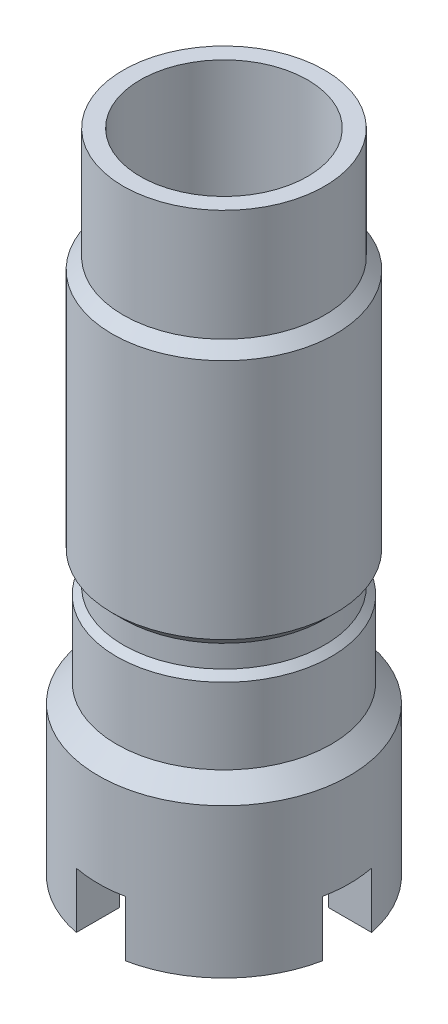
ISO-10303-21;
HEADER;
FILE_DESCRIPTION(('STEP AP214'),'2;1');
FILE_NAME('part.step','',(''),(''),'','','');
FILE_SCHEMA(('AUTOMOTIVE_DESIGN { 1 0 10303 214 1 1 1 1 }'));
ENDSEC;
DATA;
#1=APPLICATION_CONTEXT('core data for automotive mechanical design processes');
#2=APPLICATION_PROTOCOL_DEFINITION('international standard','automotive_design',2000,#1);
#3=PRODUCT_CONTEXT('',#1,'mechanical');
#4=PRODUCT('Part','Part','',(#3));
#5=PRODUCT_RELATED_PRODUCT_CATEGORY('part','',(#4));
#6=PRODUCT_DEFINITION_FORMATION('','',#4);
#7=PRODUCT_DEFINITION_CONTEXT('part definition',#1,'design');
#8=PRODUCT_DEFINITION('design','',#6,#7);
#9=PRODUCT_DEFINITION_SHAPE('','',#8);
#10=(LENGTH_UNIT() NAMED_UNIT(*) SI_UNIT(.MILLI.,.METRE.));
#11=(NAMED_UNIT(*) PLANE_ANGLE_UNIT() SI_UNIT($,.RADIAN.));
#12=(NAMED_UNIT(*) SI_UNIT($,.STERADIAN.) SOLID_ANGLE_UNIT());
#13=UNCERTAINTY_MEASURE_WITH_UNIT(LENGTH_MEASURE(1.E-05),#10,'distance_accuracy_value','');
#14=(GEOMETRIC_REPRESENTATION_CONTEXT(3) GLOBAL_UNCERTAINTY_ASSIGNED_CONTEXT((#13)) GLOBAL_UNIT_ASSIGNED_CONTEXT((#10,
#11,#12)) REPRESENTATION_CONTEXT('',''));
#15=CARTESIAN_POINT('',(0.,0.,0.));
#16=DIRECTION('',(0.,0.,1.));
#17=DIRECTION('',(1.,0.,0.));
#18=AXIS2_PLACEMENT_3D('',#15,#16,#17);
#19=CARTESIAN_POINT('',(-4.7625,0.,0.));
#20=DIRECTION('',(0.,1.,0.));
#21=DIRECTION('',(0.,0.,1.));
#22=AXIS2_PLACEMENT_3D('',#19,#20,#21);
#23=PLANE('',#22);
#24=CARTESIAN_POINT('',(0.,0.,0.));
#25=DIRECTION('',(0.,-1.,0.));
#26=DIRECTION('',(0.,0.,-1.));
#27=AXIS2_PLACEMENT_3D('',#24,#25,#26);
#28=CIRCLE('',#27,7.14375);
#29=CARTESIAN_POINT('',(-7.00582293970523,0.,-1.397));
#30=VERTEX_POINT('',#29);
#31=CARTESIAN_POINT('',(-1.397,0.,-7.00582293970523));
#32=VERTEX_POINT('',#31);
#33=EDGE_CURVE('E217',#30,#32,#28,.T.);
#34=ORIENTED_EDGE('',*,*,#33,.T.);
#35=DIRECTION('',(0.,0.,-1.));
#36=VECTOR('',#35,1.);
#37=CARTESIAN_POINT('',(-1.397,0.,-7.14375));
#38=LINE('',#37,#36);
#39=CARTESIAN_POINT('',(-1.397,0.,-4.55299870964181));
#40=VERTEX_POINT('',#39);
#41=EDGE_CURVE('E201',#40,#32,#38,.T.);
#42=ORIENTED_EDGE('',*,*,#41,.F.);
#43=CARTESIAN_POINT('',(0.,0.,0.));
#44=DIRECTION('',(0.,-1.,0.));
#45=DIRECTION('',(0.,0.,-1.));
#46=AXIS2_PLACEMENT_3D('',#43,#44,#45);
#47=CIRCLE('',#46,4.7625);
#48=CARTESIAN_POINT('',(-4.55299870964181,0.,-1.397));
#49=VERTEX_POINT('',#48);
#50=EDGE_CURVE('E215',#49,#40,#47,.T.);
#51=ORIENTED_EDGE('',*,*,#50,.F.);
#52=DIRECTION('',(1.,0.,0.));
#53=VECTOR('',#52,1.);
#54=CARTESIAN_POINT('',(-7.14375,0.,-1.397));
#55=LINE('',#54,#53);
#56=EDGE_CURVE('E269',#30,#49,#55,.T.);
#57=ORIENTED_EDGE('',*,*,#56,.F.);
#58=EDGE_LOOP('',(#34,#42,#51,#57));
#59=FACE_BOUND('',#58,.T.);
#60=ADVANCED_FACE('F84',(#59),#23,.F.);
#61=CARTESIAN_POINT('',(-1.397,0.,7.00582293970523));
#62=VERTEX_POINT('',#61);
#63=CARTESIAN_POINT('',(-7.00582293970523,0.,1.397));
#64=VERTEX_POINT('',#63);
#65=EDGE_CURVE('E322',#62,#64,#28,.T.);
#66=ORIENTED_EDGE('',*,*,#65,.T.);
#67=DIRECTION('',(-1.,0.,0.));
#68=VECTOR('',#67,1.);
#69=CARTESIAN_POINT('',(-7.14375,0.,1.397));
#70=LINE('',#69,#68);
#71=CARTESIAN_POINT('',(-4.55299870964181,0.,1.397));
#72=VERTEX_POINT('',#71);
#73=EDGE_CURVE('E262',#72,#64,#70,.T.);
#74=ORIENTED_EDGE('',*,*,#73,.F.);
#75=CARTESIAN_POINT('',(-1.397,0.,4.55299870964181));
#76=VERTEX_POINT('',#75);
#77=EDGE_CURVE('E223',#76,#72,#47,.T.);
#78=ORIENTED_EDGE('',*,*,#77,.F.);
#79=DIRECTION('',(0.,0.,-1.));
#80=VECTOR('',#79,1.);
#81=CARTESIAN_POINT('',(-1.397,0.,1.397));
#82=LINE('',#81,#80);
#83=EDGE_CURVE('E260',#62,#76,#82,.T.);
#84=ORIENTED_EDGE('',*,*,#83,.F.);
#85=EDGE_LOOP('',(#66,#74,#78,#84));
#86=FACE_BOUND('',#85,.T.);
#87=ADVANCED_FACE('F373',(#86),#23,.F.);
#88=CARTESIAN_POINT('',(7.00582293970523,0.,1.397));
#89=VERTEX_POINT('',#88);
#90=CARTESIAN_POINT('',(1.397,0.,7.00582293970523));
#91=VERTEX_POINT('',#90);
#92=EDGE_CURVE('E256',#89,#91,#28,.T.);
#93=ORIENTED_EDGE('',*,*,#92,.T.);
#94=DIRECTION('',(0.,0.,1.));
#95=VECTOR('',#94,1.);
#96=CARTESIAN_POINT('',(1.397,0.,1.397));
#97=LINE('',#96,#95);
#98=CARTESIAN_POINT('',(1.397,0.,4.55299870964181));
#99=VERTEX_POINT('',#98);
#100=EDGE_CURVE('E255',#99,#91,#97,.T.);
#101=ORIENTED_EDGE('',*,*,#100,.F.);
#102=CARTESIAN_POINT('',(4.55299870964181,0.,1.397));
#103=VERTEX_POINT('',#102);
#104=EDGE_CURVE('E228',#103,#99,#47,.T.);
#105=ORIENTED_EDGE('',*,*,#104,.F.);
#106=DIRECTION('',(-1.,0.,0.));
#107=VECTOR('',#106,1.);
#108=CARTESIAN_POINT('',(1.397,0.,1.397));
#109=LINE('',#108,#107);
#110=EDGE_CURVE('E253',#89,#103,#109,.T.);
#111=ORIENTED_EDGE('',*,*,#110,.F.);
#112=EDGE_LOOP('',(#93,#101,#105,#111));
#113=FACE_BOUND('',#112,.T.);
#114=ADVANCED_FACE('F252',(#113),#23,.F.);
#115=CARTESIAN_POINT('',(1.397,0.,-7.00582293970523));
#116=VERTEX_POINT('',#115);
#117=CARTESIAN_POINT('',(7.00582293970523,0.,-1.397));
#118=VERTEX_POINT('',#117);
#119=EDGE_CURVE('E316',#116,#118,#28,.T.);
#120=ORIENTED_EDGE('',*,*,#119,.T.);
#121=DIRECTION('',(1.,0.,0.));
#122=VECTOR('',#121,1.);
#123=CARTESIAN_POINT('',(1.397,0.,-1.397));
#124=LINE('',#123,#122);
#125=CARTESIAN_POINT('',(4.55299870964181,0.,-1.397));
#126=VERTEX_POINT('',#125);
#127=EDGE_CURVE('E264',#126,#118,#124,.T.);
#128=ORIENTED_EDGE('',*,*,#127,.F.);
#129=CARTESIAN_POINT('',(1.397,0.,-4.55299870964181));
#130=VERTEX_POINT('',#129);
#131=EDGE_CURVE('E226',#130,#126,#47,.T.);
#132=ORIENTED_EDGE('',*,*,#131,.F.);
#133=DIRECTION('',(0.,0.,1.));
#134=VECTOR('',#133,1.);
#135=CARTESIAN_POINT('',(1.397,0.,-7.14375));
#136=LINE('',#135,#134);
#137=EDGE_CURVE('E218',#116,#130,#136,.T.);
#138=ORIENTED_EDGE('',*,*,#137,.F.);
#139=EDGE_LOOP('',(#120,#128,#132,#138));
#140=FACE_BOUND('',#139,.T.);
#141=ADVANCED_FACE('F86',(#140),#23,.F.);
#142=CARTESIAN_POINT('',(0.,0.,0.));
#143=DIRECTION('',(0.,-1.,0.));
#144=DIRECTION('',(0.,0.,-1.));
#145=AXIS2_PLACEMENT_3D('',#142,#143,#144);
#146=CYLINDRICAL_SURFACE('',#145,7.14375);
#147=ORIENTED_EDGE('',*,*,#92,.F.);
#148=DIRECTION('',(0.,-1.,0.));
#149=VECTOR('',#148,1.);
#150=CARTESIAN_POINT('',(7.00582293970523,0.,1.397));
#151=LINE('',#150,#149);
#152=CARTESIAN_POINT('',(7.00582293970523,3.175,1.397));
#153=VERTEX_POINT('',#152);
#154=EDGE_CURVE('E281',#89,#153,#151,.F.);
#155=ORIENTED_EDGE('',*,*,#154,.T.);
#156=CARTESIAN_POINT('',(0.,3.175,0.));
#157=DIRECTION('',(0.,1.,0.));
#158=DIRECTION('',(0.,0.,1.));
#159=AXIS2_PLACEMENT_3D('',#156,#157,#158);
#160=CIRCLE('',#159,7.14375);
#161=CARTESIAN_POINT('',(7.00582293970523,3.175,-1.397));
#162=VERTEX_POINT('',#161);
#163=EDGE_CURVE('E274',#153,#162,#160,.T.);
#164=ORIENTED_EDGE('',*,*,#163,.T.);
#165=DIRECTION('',(0.,-1.,0.));
#166=VECTOR('',#165,1.);
#167=CARTESIAN_POINT('',(7.00582293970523,0.,-1.397));
#168=LINE('',#167,#166);
#169=EDGE_CURVE('E278',#162,#118,#168,.T.);
#170=ORIENTED_EDGE('',*,*,#169,.T.);
#171=ORIENTED_EDGE('',*,*,#119,.F.);
#172=DIRECTION('',(0.,-1.,0.));
#173=VECTOR('',#172,1.);
#174=CARTESIAN_POINT('',(1.397,0.,-7.00582293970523));
#175=LINE('',#174,#173);
#176=CARTESIAN_POINT('',(1.397,3.175,-7.00582293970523));
#177=VERTEX_POINT('',#176);
#178=EDGE_CURVE('E275',#116,#177,#175,.F.);
#179=ORIENTED_EDGE('',*,*,#178,.T.);
#180=CARTESIAN_POINT('',(-1.397,3.175,-7.00582293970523));
#181=VERTEX_POINT('',#180);
#182=EDGE_CURVE('E607',#177,#181,#160,.T.);
#183=ORIENTED_EDGE('',*,*,#182,.T.);
#184=DIRECTION('',(0.,-1.,0.));
#185=VECTOR('',#184,1.);
#186=CARTESIAN_POINT('',(-1.397,0.,-7.00582293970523));
#187=LINE('',#186,#185);
#188=EDGE_CURVE('E224',#181,#32,#187,.T.);
#189=ORIENTED_EDGE('',*,*,#188,.T.);
#190=ORIENTED_EDGE('',*,*,#33,.F.);
#191=DIRECTION('',(0.,-1.,0.));
#192=VECTOR('',#191,1.);
#193=CARTESIAN_POINT('',(-7.00582293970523,0.,-1.397));
#194=LINE('',#193,#192);
#195=CARTESIAN_POINT('',(-7.00582293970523,3.175,-1.397));
#196=VERTEX_POINT('',#195);
#197=EDGE_CURVE('E229',#30,#196,#194,.F.);
#198=ORIENTED_EDGE('',*,*,#197,.T.);
#199=CARTESIAN_POINT('',(-7.00582293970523,3.175,1.397));
#200=VERTEX_POINT('',#199);
#201=EDGE_CURVE('E273',#196,#200,#160,.T.);
#202=ORIENTED_EDGE('',*,*,#201,.T.);
#203=DIRECTION('',(0.,-1.,0.));
#204=VECTOR('',#203,1.);
#205=CARTESIAN_POINT('',(-7.00582293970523,0.,1.397));
#206=LINE('',#205,#204);
#207=EDGE_CURVE('E289',#200,#64,#206,.T.);
#208=ORIENTED_EDGE('',*,*,#207,.T.);
#209=ORIENTED_EDGE('',*,*,#65,.F.);
#210=DIRECTION('',(0.,-1.,0.));
#211=VECTOR('',#210,1.);
#212=CARTESIAN_POINT('',(-1.397,0.,7.00582293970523));
#213=LINE('',#212,#211);
#214=CARTESIAN_POINT('',(-1.397,3.175,7.00582293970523));
#215=VERTEX_POINT('',#214);
#216=EDGE_CURVE('E286',#62,#215,#213,.F.);
#217=ORIENTED_EDGE('',*,*,#216,.T.);
#218=CARTESIAN_POINT('',(1.397,3.175,7.00582293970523));
#219=VERTEX_POINT('',#218);
#220=EDGE_CURVE('E271',#215,#219,#160,.T.);
#221=ORIENTED_EDGE('',*,*,#220,.T.);
#222=DIRECTION('',(0.,-1.,0.));
#223=VECTOR('',#222,1.);
#224=CARTESIAN_POINT('',(1.397,0.,7.00582293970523));
#225=LINE('',#224,#223);
#226=EDGE_CURVE('E284',#219,#91,#225,.T.);
#227=ORIENTED_EDGE('',*,*,#226,.T.);
#228=EDGE_LOOP('',(#147,#155,#164,#170,#171,#179,#183,#189,#190,#198,#202,#208,#209,#217,#221,#227));
#229=FACE_BOUND('',#228,.T.);
#230=CARTESIAN_POINT('',(0.,8.48995000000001,0.));
#231=DIRECTION('',(0.,-1.,0.));
#232=DIRECTION('',(0.,0.,-1.));
#233=AXIS2_PLACEMENT_3D('',#230,#231,#232);
#234=CIRCLE('',#233,7.14375);
#235=CARTESIAN_POINT('',(0.,8.48995000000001,-7.14375));
#236=VERTEX_POINT('',#235);
#237=EDGE_CURVE('E324',#236,#236,#234,.T.);
#238=ORIENTED_EDGE('',*,*,#237,.T.);
#239=EDGE_LOOP('',(#238));
#240=FACE_BOUND('',#239,.T.);
#241=ADVANCED_FACE('F294',(#229,#240),#146,.T.);
#242=CARTESIAN_POINT('',(0.,9.525,0.));
#243=DIRECTION('',(0.,-1.,0.));
#244=DIRECTION('',(0.,0.,-1.));
#245=AXIS2_PLACEMENT_3D('',#242,#243,#244);
#246=CONICAL_SURFACE('',#245,6.1087,0.78539816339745);
#247=ORIENTED_EDGE('',*,*,#237,.F.);
#248=EDGE_LOOP('',(#247));
#249=FACE_BOUND('',#248,.T.);
#250=CARTESIAN_POINT('',(0.,9.525,0.));
#251=DIRECTION('',(0.,-1.,0.));
#252=DIRECTION('',(0.,0.,-1.));
#253=AXIS2_PLACEMENT_3D('',#250,#251,#252);
#254=CIRCLE('',#253,6.1087);
#255=CARTESIAN_POINT('',(0.,9.525,-6.1087));
#256=VERTEX_POINT('',#255);
#257=EDGE_CURVE('E327',#256,#256,#254,.T.);
#258=ORIENTED_EDGE('',*,*,#257,.T.);
#259=EDGE_LOOP('',(#258));
#260=FACE_BOUND('',#259,.T.);
#261=ADVANCED_FACE('F383',(#249,#260),#246,.T.);
#262=CARTESIAN_POINT('',(0.,0.,0.));
#263=DIRECTION('',(0.,-1.,0.));
#264=DIRECTION('',(0.,0.,-1.));
#265=AXIS2_PLACEMENT_3D('',#262,#263,#264);
#266=CYLINDRICAL_SURFACE('',#265,6.1087);
#267=ORIENTED_EDGE('',*,*,#257,.F.);
#268=EDGE_LOOP('',(#267));
#269=FACE_BOUND('',#268,.T.);
#270=CARTESIAN_POINT('',(0.,13.843,0.));
#271=DIRECTION('',(0.,-1.,0.));
#272=DIRECTION('',(0.,0.,-1.));
#273=AXIS2_PLACEMENT_3D('',#270,#271,#272);
#274=CIRCLE('',#273,6.1087);
#275=CARTESIAN_POINT('',(0.,13.843,-6.1087));
#276=VERTEX_POINT('',#275);
#277=EDGE_CURVE('E330',#276,#276,#274,.T.);
#278=ORIENTED_EDGE('',*,*,#277,.T.);
#279=EDGE_LOOP('',(#278));
#280=FACE_BOUND('',#279,.T.);
#281=ADVANCED_FACE('F461',(#269,#280),#266,.T.);
#282=CARTESIAN_POINT('',(0.,14.224,0.));
#283=DIRECTION('',(0.,-1.,0.));
#284=DIRECTION('',(0.,0.,-1.));
#285=AXIS2_PLACEMENT_3D('',#282,#283,#284);
#286=CONICAL_SURFACE('',#285,5.7277,0.785398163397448);
#287=ORIENTED_EDGE('',*,*,#277,.F.);
#288=EDGE_LOOP('',(#287));
#289=FACE_BOUND('',#288,.T.);
#290=CARTESIAN_POINT('',(0.,14.224,0.));
#291=DIRECTION('',(0.,-1.,0.));
#292=DIRECTION('',(0.,0.,-1.));
#293=AXIS2_PLACEMENT_3D('',#290,#291,#292);
#294=CIRCLE('',#293,5.7277);
#295=CARTESIAN_POINT('',(0.,14.224,-5.7277));
#296=VERTEX_POINT('',#295);
#297=EDGE_CURVE('E335',#296,#296,#294,.T.);
#298=ORIENTED_EDGE('',*,*,#297,.T.);
#299=EDGE_LOOP('',(#298));
#300=FACE_BOUND('',#299,.T.);
#301=ADVANCED_FACE('F451',(#289,#300),#286,.T.);
#302=CARTESIAN_POINT('',(0.,0.,0.));
#303=DIRECTION('',(0.,-1.,0.));
#304=DIRECTION('',(0.,0.,-1.));
#305=AXIS2_PLACEMENT_3D('',#302,#303,#304);
#306=CYLINDRICAL_SURFACE('',#305,5.7277);
#307=ORIENTED_EDGE('',*,*,#297,.F.);
#308=EDGE_LOOP('',(#307));
#309=FACE_BOUND('',#308,.T.);
#310=CARTESIAN_POINT('',(0.,15.494,0.));
#311=DIRECTION('',(0.,-1.,0.));
#312=DIRECTION('',(0.,0.,-1.));
#313=AXIS2_PLACEMENT_3D('',#310,#311,#312);
#314=CIRCLE('',#313,5.7277);
#315=CARTESIAN_POINT('',(0.,15.494,-5.7277));
#316=VERTEX_POINT('',#315);
#317=EDGE_CURVE('E338',#316,#316,#314,.T.);
#318=ORIENTED_EDGE('',*,*,#317,.T.);
#319=EDGE_LOOP('',(#318));
#320=FACE_BOUND('',#319,.T.);
#321=ADVANCED_FACE('F441',(#309,#320),#306,.T.);
#322=CARTESIAN_POINT('',(0.,16.1163,0.));
#323=DIRECTION('',(0.,1.,0.));
#324=DIRECTION('',(0.,0.,1.));
#325=AXIS2_PLACEMENT_3D('',#322,#323,#324);
#326=CONICAL_SURFACE('',#325,6.35,0.785398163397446);
#327=ORIENTED_EDGE('',*,*,#317,.F.);
#328=EDGE_LOOP('',(#327));
#329=FACE_BOUND('',#328,.T.);
#330=CARTESIAN_POINT('',(0.,16.1163,0.));
#331=DIRECTION('',(0.,-1.,0.));
#332=DIRECTION('',(0.,0.,-1.));
#333=AXIS2_PLACEMENT_3D('',#330,#331,#332);
#334=CIRCLE('',#333,6.35);
#335=CARTESIAN_POINT('',(0.,16.1163,-6.35));
#336=VERTEX_POINT('',#335);
#337=EDGE_CURVE('E341',#336,#336,#334,.T.);
#338=ORIENTED_EDGE('',*,*,#337,.T.);
#339=EDGE_LOOP('',(#338));
#340=FACE_BOUND('',#339,.T.);
#341=ADVANCED_FACE('F431',(#329,#340),#326,.T.);
#342=CARTESIAN_POINT('',(0.,0.,0.));
#343=DIRECTION('',(0.,-1.,0.));
#344=DIRECTION('',(0.,0.,-1.));
#345=AXIS2_PLACEMENT_3D('',#342,#343,#344);
#346=CYLINDRICAL_SURFACE('',#345,6.35);
#347=ORIENTED_EDGE('',*,*,#337,.F.);
#348=EDGE_LOOP('',(#347));
#349=FACE_BOUND('',#348,.T.);
#350=CARTESIAN_POINT('',(0.,29.8577,0.));
#351=DIRECTION('',(0.,-1.,0.));
#352=DIRECTION('',(0.,0.,-1.));
#353=AXIS2_PLACEMENT_3D('',#350,#351,#352);
#354=CIRCLE('',#353,6.35);
#355=CARTESIAN_POINT('',(0.,29.8577,-6.35));
#356=VERTEX_POINT('',#355);
#357=EDGE_CURVE('E344',#356,#356,#354,.T.);
#358=ORIENTED_EDGE('',*,*,#357,.T.);
#359=EDGE_LOOP('',(#358));
#360=FACE_BOUND('',#359,.T.);
#361=ADVANCED_FACE('F421',(#349,#360),#346,.T.);
#362=CARTESIAN_POINT('',(0.,30.48,0.));
#363=DIRECTION('',(0.,-1.,0.));
#364=DIRECTION('',(0.,0.,-1.));
#365=AXIS2_PLACEMENT_3D('',#362,#363,#364);
#366=CONICAL_SURFACE('',#365,5.7277,0.78539816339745);
#367=ORIENTED_EDGE('',*,*,#357,.F.);
#368=EDGE_LOOP('',(#367));
#369=FACE_BOUND('',#368,.T.);
#370=CARTESIAN_POINT('',(0.,30.48,0.));
#371=DIRECTION('',(0.,-1.,0.));
#372=DIRECTION('',(0.,0.,-1.));
#373=AXIS2_PLACEMENT_3D('',#370,#371,#372);
#374=CIRCLE('',#373,5.7277);
#375=CARTESIAN_POINT('',(0.,30.48,-5.7277));
#376=VERTEX_POINT('',#375);
#377=EDGE_CURVE('E347',#376,#376,#374,.T.);
#378=ORIENTED_EDGE('',*,*,#377,.T.);
#379=EDGE_LOOP('',(#378));
#380=FACE_BOUND('',#379,.T.);
#381=ADVANCED_FACE('F411',(#369,#380),#366,.T.);
#382=CARTESIAN_POINT('',(0.,0.,0.));
#383=DIRECTION('',(0.,-1.,0.));
#384=DIRECTION('',(0.,0.,-1.));
#385=AXIS2_PLACEMENT_3D('',#382,#383,#384);
#386=CYLINDRICAL_SURFACE('',#385,5.7277);
#387=ORIENTED_EDGE('',*,*,#377,.F.);
#388=EDGE_LOOP('',(#387));
#389=FACE_BOUND('',#388,.T.);
#390=CARTESIAN_POINT('',(0.,36.83,0.));
#391=DIRECTION('',(0.,-1.,0.));
#392=DIRECTION('',(0.,0.,-1.));
#393=AXIS2_PLACEMENT_3D('',#390,#391,#392);
#394=CIRCLE('',#393,5.7277);
#395=CARTESIAN_POINT('',(0.,36.83,-5.7277));
#396=VERTEX_POINT('',#395);
#397=EDGE_CURVE('E238',#396,#396,#394,.T.);
#398=ORIENTED_EDGE('',*,*,#397,.T.);
#399=EDGE_LOOP('',(#398));
#400=FACE_BOUND('',#399,.T.);
#401=ADVANCED_FACE('F353',(#389,#400),#386,.T.);
#402=CARTESIAN_POINT('',(-5.7277,36.83,0.));
#403=DIRECTION('',(0.,-1.,0.));
#404=DIRECTION('',(0.,0.,-1.));
#405=AXIS2_PLACEMENT_3D('',#402,#403,#404);
#406=PLANE('',#405);
#407=ORIENTED_EDGE('',*,*,#397,.F.);
#408=EDGE_LOOP('',(#407));
#409=FACE_BOUND('',#408,.T.);
#410=CARTESIAN_POINT('',(0.,36.83,0.));
#411=DIRECTION('',(0.,-1.,0.));
#412=DIRECTION('',(0.,0.,-1.));
#413=AXIS2_PLACEMENT_3D('',#410,#411,#412);
#414=CIRCLE('',#413,4.7625);
#415=CARTESIAN_POINT('',(0.,36.83,-4.7625));
#416=VERTEX_POINT('',#415);
#417=EDGE_CURVE('E233',#416,#416,#414,.T.);
#418=ORIENTED_EDGE('',*,*,#417,.T.);
#419=EDGE_LOOP('',(#418));
#420=FACE_BOUND('',#419,.T.);
#421=ADVANCED_FACE('F355',(#409,#420),#406,.F.);
#422=CARTESIAN_POINT('',(0.,0.,0.));
#423=DIRECTION('',(0.,-1.,0.));
#424=DIRECTION('',(0.,0.,-1.));
#425=AXIS2_PLACEMENT_3D('',#422,#423,#424);
#426=CYLINDRICAL_SURFACE('',#425,4.7625);
#427=CARTESIAN_POINT('',(0.,3.175,0.));
#428=DIRECTION('',(0.,1.,0.));
#429=DIRECTION('',(0.,0.,1.));
#430=AXIS2_PLACEMENT_3D('',#427,#428,#429);
#431=CIRCLE('',#430,4.7625);
#432=CARTESIAN_POINT('',(-4.55299870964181,3.175,1.397));
#433=VERTEX_POINT('',#432);
#434=CARTESIAN_POINT('',(-4.55299870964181,3.175,-1.397));
#435=VERTEX_POINT('',#434);
#436=EDGE_CURVE('E208',#433,#435,#431,.F.);
#437=ORIENTED_EDGE('',*,*,#436,.T.);
#438=DIRECTION('',(0.,-1.,0.));
#439=VECTOR('',#438,1.);
#440=CARTESIAN_POINT('',(-4.55299870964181,0.,-1.397));
#441=LINE('',#440,#439);
#442=EDGE_CURVE('E12',#435,#49,#441,.T.);
#443=ORIENTED_EDGE('',*,*,#442,.T.);
#444=ORIENTED_EDGE('',*,*,#50,.T.);
#445=DIRECTION('',(0.,-1.,0.));
#446=VECTOR('',#445,1.);
#447=CARTESIAN_POINT('',(-1.397,0.,-4.55299870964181));
#448=LINE('',#447,#446);
#449=CARTESIAN_POINT('',(-1.397,3.175,-4.55299870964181));
#450=VERTEX_POINT('',#449);
#451=EDGE_CURVE('E197',#40,#450,#448,.F.);
#452=ORIENTED_EDGE('',*,*,#451,.T.);
#453=CARTESIAN_POINT('',(1.397,3.175,-4.55299870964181));
#454=VERTEX_POINT('',#453);
#455=EDGE_CURVE('E599',#450,#454,#431,.F.);
#456=ORIENTED_EDGE('',*,*,#455,.T.);
#457=DIRECTION('',(0.,-1.,0.));
#458=VECTOR('',#457,1.);
#459=CARTESIAN_POINT('',(1.397,0.,-4.55299870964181));
#460=LINE('',#459,#458);
#461=EDGE_CURVE('E209',#454,#130,#460,.T.);
#462=ORIENTED_EDGE('',*,*,#461,.T.);
#463=ORIENTED_EDGE('',*,*,#131,.T.);
#464=DIRECTION('',(0.,-1.,0.));
#465=VECTOR('',#464,1.);
#466=CARTESIAN_POINT('',(4.55299870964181,0.,-1.397));
#467=LINE('',#466,#465);
#468=CARTESIAN_POINT('',(4.55299870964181,3.175,-1.397));
#469=VERTEX_POINT('',#468);
#470=EDGE_CURVE('E312',#126,#469,#467,.F.);
#471=ORIENTED_EDGE('',*,*,#470,.T.);
#472=CARTESIAN_POINT('',(4.55299870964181,3.175,1.397));
#473=VERTEX_POINT('',#472);
#474=EDGE_CURVE('E321',#469,#473,#431,.F.);
#475=ORIENTED_EDGE('',*,*,#474,.T.);
#476=DIRECTION('',(0.,-1.,0.));
#477=VECTOR('',#476,1.);
#478=CARTESIAN_POINT('',(4.55299870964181,0.,1.397));
#479=LINE('',#478,#477);
#480=EDGE_CURVE('E247',#473,#103,#479,.T.);
#481=ORIENTED_EDGE('',*,*,#480,.T.);
#482=ORIENTED_EDGE('',*,*,#104,.T.);
#483=DIRECTION('',(0.,-1.,0.));
#484=VECTOR('',#483,1.);
#485=CARTESIAN_POINT('',(1.397,0.,4.55299870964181));
#486=LINE('',#485,#484);
#487=CARTESIAN_POINT('',(1.397,3.175,4.55299870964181));
#488=VERTEX_POINT('',#487);
#489=EDGE_CURVE('E244',#99,#488,#486,.F.);
#490=ORIENTED_EDGE('',*,*,#489,.T.);
#491=CARTESIAN_POINT('',(-1.397,3.175,4.55299870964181));
#492=VERTEX_POINT('',#491);
#493=EDGE_CURVE('E318',#488,#492,#431,.F.);
#494=ORIENTED_EDGE('',*,*,#493,.T.);
#495=DIRECTION('',(0.,-1.,0.));
#496=VECTOR('',#495,1.);
#497=CARTESIAN_POINT('',(-1.397,0.,4.55299870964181));
#498=LINE('',#497,#496);
#499=EDGE_CURVE('E604',#492,#76,#498,.T.);
#500=ORIENTED_EDGE('',*,*,#499,.T.);
#501=ORIENTED_EDGE('',*,*,#77,.T.);
#502=DIRECTION('',(0.,-1.,0.));
#503=VECTOR('',#502,1.);
#504=CARTESIAN_POINT('',(-4.55299870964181,0.,1.397));
#505=LINE('',#504,#503);
#506=EDGE_CURVE('E92',#72,#433,#505,.F.);
#507=ORIENTED_EDGE('',*,*,#506,.T.);
#508=EDGE_LOOP('',(#437,#443,#444,#452,#456,#462,#463,#471,#475,#481,#482,#490,#494,#500,#501,#507));
#509=FACE_BOUND('',#508,.T.);
#510=ORIENTED_EDGE('',*,*,#417,.F.);
#511=EDGE_LOOP('',(#510));
#512=FACE_BOUND('',#511,.T.);
#513=ADVANCED_FACE('F221',(#509,#512),#426,.F.);
#514=CARTESIAN_POINT('',(-1.397,3.175,-1.397));
#515=DIRECTION('',(0.,1.,0.));
#516=DIRECTION('',(0.,0.,1.));
#517=AXIS2_PLACEMENT_3D('',#514,#515,#516);
#518=PLANE('',#517);
#519=ORIENTED_EDGE('',*,*,#220,.F.);
#520=DIRECTION('',(0.,0.,-1.));
#521=VECTOR('',#520,1.);
#522=CARTESIAN_POINT('',(-1.397,3.175,1.397));
#523=LINE('',#522,#521);
#524=EDGE_CURVE('E302',#215,#492,#523,.T.);
#525=ORIENTED_EDGE('',*,*,#524,.T.);
#526=ORIENTED_EDGE('',*,*,#493,.F.);
#527=DIRECTION('',(0.,0.,1.));
#528=VECTOR('',#527,1.);
#529=CARTESIAN_POINT('',(1.397,3.175,1.397));
#530=LINE('',#529,#528);
#531=EDGE_CURVE('E615',#488,#219,#530,.T.);
#532=ORIENTED_EDGE('',*,*,#531,.T.);
#533=EDGE_LOOP('',(#519,#525,#526,#532));
#534=FACE_BOUND('',#533,.T.);
#535=ADVANCED_FACE('F361',(#534),#518,.F.);
#536=CARTESIAN_POINT('',(1.397,3.175,1.397));
#537=DIRECTION('',(1.,0.,0.));
#538=DIRECTION('',(0.,0.,-1.));
#539=AXIS2_PLACEMENT_3D('',#536,#537,#538);
#540=PLANE('',#539);
#541=ORIENTED_EDGE('',*,*,#531,.F.);
#542=ORIENTED_EDGE('',*,*,#489,.F.);
#543=ORIENTED_EDGE('',*,*,#100,.T.);
#544=ORIENTED_EDGE('',*,*,#226,.F.);
#545=EDGE_LOOP('',(#541,#542,#543,#544));
#546=FACE_BOUND('',#545,.T.);
#547=ADVANCED_FACE('F366',(#546),#540,.F.);
#548=CARTESIAN_POINT('',(-1.397,3.175,1.397));
#549=DIRECTION('',(-1.,0.,0.));
#550=DIRECTION('',(0.,0.,1.));
#551=AXIS2_PLACEMENT_3D('',#548,#549,#550);
#552=PLANE('',#551);
#553=ORIENTED_EDGE('',*,*,#83,.T.);
#554=ORIENTED_EDGE('',*,*,#499,.F.);
#555=ORIENTED_EDGE('',*,*,#524,.F.);
#556=ORIENTED_EDGE('',*,*,#216,.F.);
#557=EDGE_LOOP('',(#553,#554,#555,#556));
#558=FACE_BOUND('',#557,.T.);
#559=ADVANCED_FACE('F505',(#558),#552,.F.);
#560=DIRECTION('',(-1.,0.,0.));
#561=VECTOR('',#560,1.);
#562=CARTESIAN_POINT('',(1.397,3.175,1.397));
#563=LINE('',#562,#561);
#564=EDGE_CURVE('E613',#153,#473,#563,.T.);
#565=ORIENTED_EDGE('',*,*,#564,.T.);
#566=ORIENTED_EDGE('',*,*,#474,.F.);
#567=DIRECTION('',(1.,0.,0.));
#568=VECTOR('',#567,1.);
#569=CARTESIAN_POINT('',(1.397,3.175,-1.397));
#570=LINE('',#569,#568);
#571=EDGE_CURVE('E609',#469,#162,#570,.T.);
#572=ORIENTED_EDGE('',*,*,#571,.T.);
#573=ORIENTED_EDGE('',*,*,#163,.F.);
#574=EDGE_LOOP('',(#565,#566,#572,#573));
#575=FACE_BOUND('',#574,.T.);
#576=ADVANCED_FACE('F369',(#575),#518,.F.);
#577=CARTESIAN_POINT('',(1.397,3.175,-1.397));
#578=DIRECTION('',(0.,0.,-1.));
#579=DIRECTION('',(-1.,0.,0.));
#580=AXIS2_PLACEMENT_3D('',#577,#578,#579);
#581=PLANE('',#580);
#582=ORIENTED_EDGE('',*,*,#571,.F.);
#583=ORIENTED_EDGE('',*,*,#470,.F.);
#584=ORIENTED_EDGE('',*,*,#127,.T.);
#585=ORIENTED_EDGE('',*,*,#169,.F.);
#586=EDGE_LOOP('',(#582,#583,#584,#585));
#587=FACE_BOUND('',#586,.T.);
#588=ADVANCED_FACE('F310',(#587),#581,.F.);
#589=CARTESIAN_POINT('',(1.397,3.175,1.397));
#590=DIRECTION('',(0.,0.,1.));
#591=DIRECTION('',(1.,0.,0.));
#592=AXIS2_PLACEMENT_3D('',#589,#590,#591);
#593=PLANE('',#592);
#594=ORIENTED_EDGE('',*,*,#110,.T.);
#595=ORIENTED_EDGE('',*,*,#480,.F.);
#596=ORIENTED_EDGE('',*,*,#564,.F.);
#597=ORIENTED_EDGE('',*,*,#154,.F.);
#598=EDGE_LOOP('',(#594,#595,#596,#597));
#599=FACE_BOUND('',#598,.T.);
#600=ADVANCED_FACE('F532',(#599),#593,.F.);
#601=DIRECTION('',(0.,0.,1.));
#602=VECTOR('',#601,1.);
#603=CARTESIAN_POINT('',(1.397,3.175,-7.14375));
#604=LINE('',#603,#602);
#605=EDGE_CURVE('E107',#177,#454,#604,.T.);
#606=ORIENTED_EDGE('',*,*,#605,.T.);
#607=ORIENTED_EDGE('',*,*,#455,.F.);
#608=DIRECTION('',(0.,0.,-1.));
#609=VECTOR('',#608,1.);
#610=CARTESIAN_POINT('',(-1.397,3.175,-7.14375));
#611=LINE('',#610,#609);
#612=EDGE_CURVE('E204',#450,#181,#611,.T.);
#613=ORIENTED_EDGE('',*,*,#612,.T.);
#614=ORIENTED_EDGE('',*,*,#182,.F.);
#615=EDGE_LOOP('',(#606,#607,#613,#614));
#616=FACE_BOUND('',#615,.T.);
#617=ADVANCED_FACE('F524',(#616),#518,.F.);
#618=CARTESIAN_POINT('',(1.397,3.175,-7.14375));
#619=DIRECTION('',(1.,0.,0.));
#620=DIRECTION('',(0.,0.,-1.));
#621=AXIS2_PLACEMENT_3D('',#618,#619,#620);
#622=PLANE('',#621);
#623=ORIENTED_EDGE('',*,*,#137,.T.);
#624=ORIENTED_EDGE('',*,*,#461,.F.);
#625=ORIENTED_EDGE('',*,*,#605,.F.);
#626=ORIENTED_EDGE('',*,*,#178,.F.);
#627=EDGE_LOOP('',(#623,#624,#625,#626));
#628=FACE_BOUND('',#627,.T.);
#629=ADVANCED_FACE('F550',(#628),#622,.F.);
#630=CARTESIAN_POINT('',(-1.397,3.175,-7.14375));
#631=DIRECTION('',(-1.,0.,0.));
#632=DIRECTION('',(0.,0.,1.));
#633=AXIS2_PLACEMENT_3D('',#630,#631,#632);
#634=PLANE('',#633);
#635=ORIENTED_EDGE('',*,*,#612,.F.);
#636=ORIENTED_EDGE('',*,*,#451,.F.);
#637=ORIENTED_EDGE('',*,*,#41,.T.);
#638=ORIENTED_EDGE('',*,*,#188,.F.);
#639=EDGE_LOOP('',(#635,#636,#637,#638));
#640=FACE_BOUND('',#639,.T.);
#641=ADVANCED_FACE('F199',(#640),#634,.F.);
#642=CARTESIAN_POINT('',(-7.14375,3.175,-1.397));
#643=DIRECTION('',(0.,0.,-1.));
#644=DIRECTION('',(-1.,0.,0.));
#645=AXIS2_PLACEMENT_3D('',#642,#643,#644);
#646=PLANE('',#645);
#647=ORIENTED_EDGE('',*,*,#56,.T.);
#648=ORIENTED_EDGE('',*,*,#442,.F.);
#649=DIRECTION('',(1.,0.,0.));
#650=VECTOR('',#649,1.);
#651=CARTESIAN_POINT('',(-7.14375,3.175,-1.397));
#652=LINE('',#651,#650);
#653=EDGE_CURVE('E99',#196,#435,#652,.T.);
#654=ORIENTED_EDGE('',*,*,#653,.F.);
#655=ORIENTED_EDGE('',*,*,#197,.F.);
#656=EDGE_LOOP('',(#647,#648,#654,#655));
#657=FACE_BOUND('',#656,.T.);
#658=ADVANCED_FACE('F298',(#657),#646,.F.);
#659=CARTESIAN_POINT('',(-7.14375,3.175,1.397));
#660=DIRECTION('',(0.,0.,1.));
#661=DIRECTION('',(1.,0.,0.));
#662=AXIS2_PLACEMENT_3D('',#659,#660,#661);
#663=PLANE('',#662);
#664=DIRECTION('',(-1.,0.,0.));
#665=VECTOR('',#664,1.);
#666=CARTESIAN_POINT('',(-7.14375,3.175,1.397));
#667=LINE('',#666,#665);
#668=EDGE_CURVE('E299',#433,#200,#667,.T.);
#669=ORIENTED_EDGE('',*,*,#668,.F.);
#670=ORIENTED_EDGE('',*,*,#506,.F.);
#671=ORIENTED_EDGE('',*,*,#73,.T.);
#672=ORIENTED_EDGE('',*,*,#207,.F.);
#673=EDGE_LOOP('',(#669,#670,#671,#672));
#674=FACE_BOUND('',#673,.T.);
#675=ADVANCED_FACE('F574',(#674),#663,.F.);
#676=ORIENTED_EDGE('',*,*,#653,.T.);
#677=ORIENTED_EDGE('',*,*,#436,.F.);
#678=ORIENTED_EDGE('',*,*,#668,.T.);
#679=ORIENTED_EDGE('',*,*,#201,.F.);
#680=EDGE_LOOP('',(#676,#677,#678,#679));
#681=FACE_BOUND('',#680,.T.);
#682=ADVANCED_FACE('F370',(#681),#518,.F.);
#683=CLOSED_SHELL('',(#60,#87,#114,#141,#241,#261,#281,#301,#321,#341,#361,#381,#401,#421,#513,
#535,#547,#559,#576,#588,#600,#617,#629,#641,#658,#675,#682));
#684=MANIFOLD_SOLID_BREP('B2',#683);
#685=ADVANCED_BREP_SHAPE_REPRESENTATION('',(#18,#684),#14);
#686=SHAPE_DEFINITION_REPRESENTATION(#9,#685);
ENDSEC;
END-ISO-10303-21;
